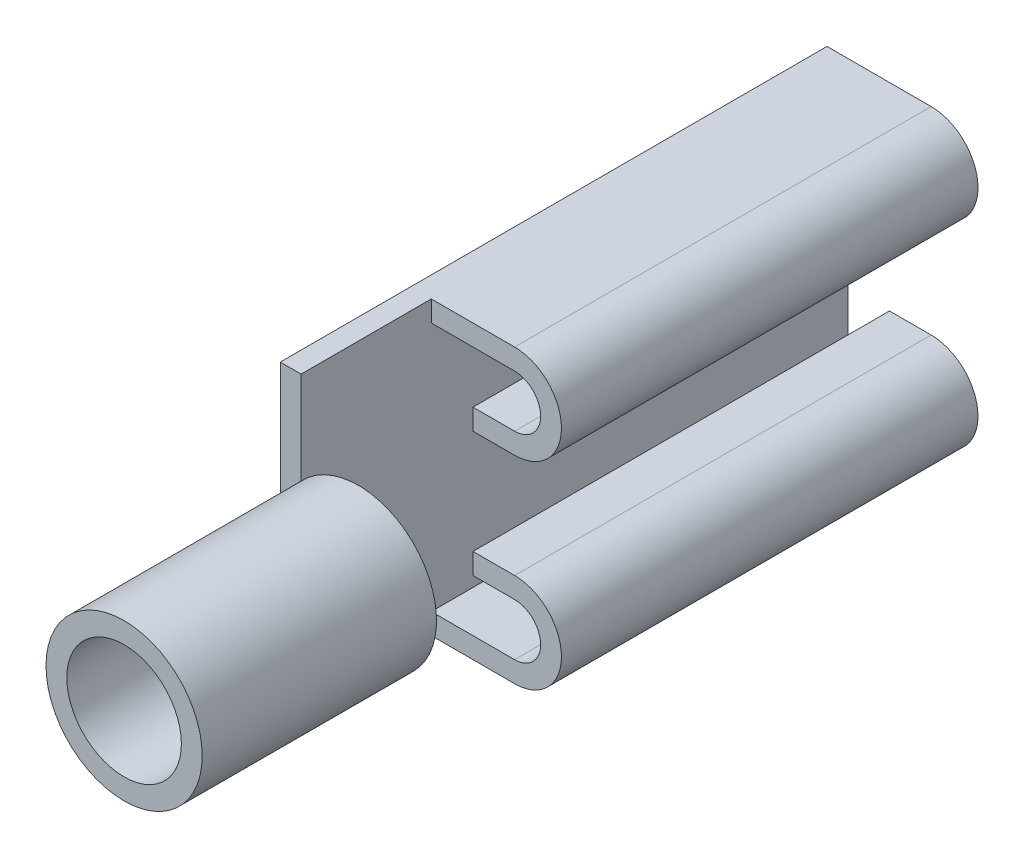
from build123d import *

# Parameters (mm, degrees)
BOSS_EXTRUDE1_DEPTH = 8
SKETCH3_W           = 0.4
SKETCH3_H           = 5.6
BOSS_EXTRUDE2_DEPTH = 2.5
SKETCH4_R           = 1.5
SKETCH4_R_2         = 1.1
BOSS_EXTRUDE3_DEPTH = 4.5


with BuildPart() as part:
    # Sketch1 → Boss-Extrude1 (new body)
    with BuildSketch(Plane.XY):
        with BuildLine():
            Line((-0.8, 2.8), (1.2, 2.8))
            ThreePointArc((1.2, 2.8), (2.1, 1.9), (1.2, 1))
            Line((1.2, 1), (0.4, 1))
            Line((0.4, 1), (0.4, 1.4))
            Line((0.4, 1.4), (1.2, 1.4))
            ThreePointArc((1.2, 1.4), (1.7, 1.9), (1.2, 2.4))
            Line((1.2, 2.4), (-0.4, 2.4))
            Line((-0.4, 2.4), (-0.4, -2.4))
            Line((-0.4, -2.4), (1.2, -2.4))
            ThreePointArc((1.2, -2.4), (1.7, -1.9), (1.2, -1.4))
            Line((1.2, -1.4), (0.4, -1.4))
            Line((0.4, -1.4), (0.4, -1))
            Line((0.4, -1), (1.2, -1))
            ThreePointArc((1.2, -1), (2.1, -1.9), (1.2, -2.8))
            Line((1.2, -2.8), (-0.8, -2.8))
            Line((-0.8, -2.8), (-0.8, 2.8))
        make_face()
    extrude(amount=BOSS_EXTRUDE1_DEPTH)

    # Sketch3 → Boss-Extrude2 (add)
    with BuildSketch(Plane.XY.offset(8)):
        with Locations((-0.6, 0)):
            Rectangle(SKETCH3_W, SKETCH3_H)
    extrude(amount=BOSS_EXTRUDE2_DEPTH)

    # Sketch4 → Boss-Extrude3 (add)
    with BuildSketch(Plane.XY.offset(10.5)):
        with Locations(Location((0.7, 0, 0), (0, 0, 180))):
            Circle(SKETCH4_R)
        with Locations(Location((0.7, 0, 0), (0, 0, 180))):
            Circle(SKETCH4_R_2, mode=Mode.SUBTRACT)
    extrude(amount=BOSS_EXTRUDE3_DEPTH)


solid = part.part
